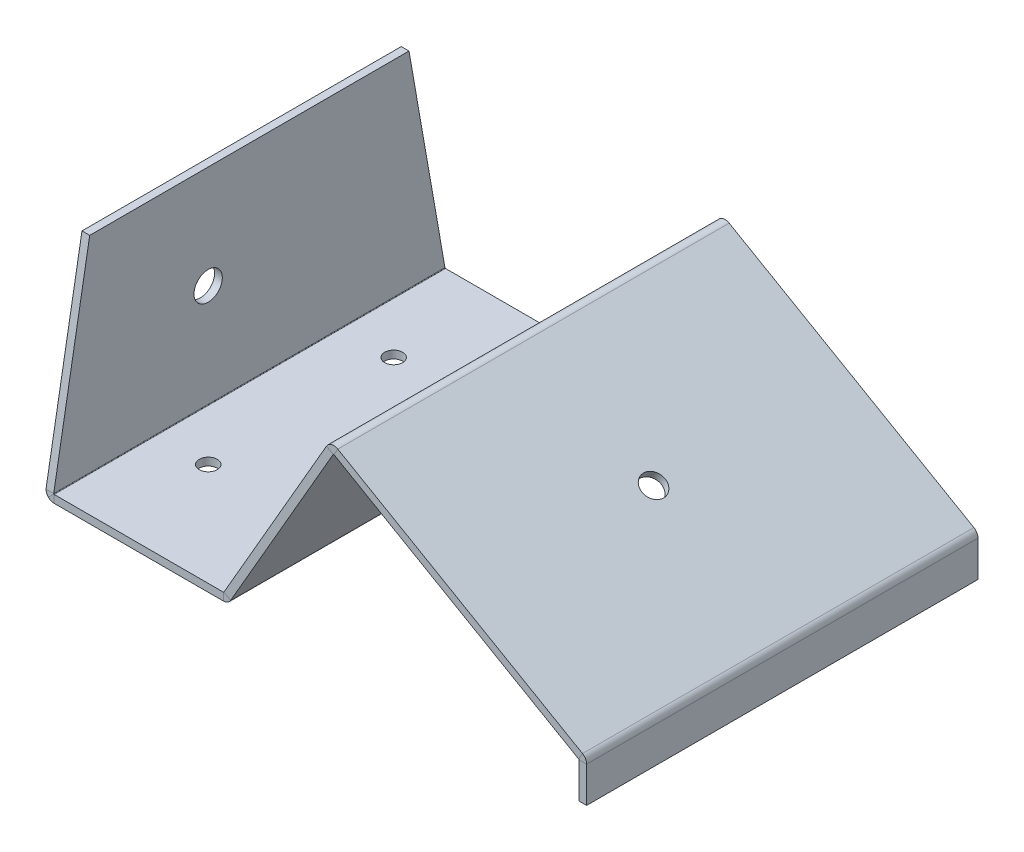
ISO-10303-21;
HEADER;
FILE_DESCRIPTION(('STEP AP214'),'2;1');
FILE_NAME('part.step','',(''),(''),'','','');
FILE_SCHEMA(('AUTOMOTIVE_DESIGN { 1 0 10303 214 1 1 1 1 }'));
ENDSEC;
DATA;
#1=APPLICATION_CONTEXT('core data for automotive mechanical design processes');
#2=APPLICATION_PROTOCOL_DEFINITION('international standard','automotive_design',2000,#1);
#3=PRODUCT_CONTEXT('',#1,'mechanical');
#4=PRODUCT('Part','Part','',(#3));
#5=PRODUCT_RELATED_PRODUCT_CATEGORY('part','',(#4));
#6=PRODUCT_DEFINITION_FORMATION('','',#4);
#7=PRODUCT_DEFINITION_CONTEXT('part definition',#1,'design');
#8=PRODUCT_DEFINITION('design','',#6,#7);
#9=PRODUCT_DEFINITION_SHAPE('','',#8);
#10=(LENGTH_UNIT() NAMED_UNIT(*) SI_UNIT(.MILLI.,.METRE.));
#11=(NAMED_UNIT(*) PLANE_ANGLE_UNIT() SI_UNIT($,.RADIAN.));
#12=(NAMED_UNIT(*) SI_UNIT($,.STERADIAN.) SOLID_ANGLE_UNIT());
#13=UNCERTAINTY_MEASURE_WITH_UNIT(LENGTH_MEASURE(1.E-05),#10,'distance_accuracy_value','');
#14=(GEOMETRIC_REPRESENTATION_CONTEXT(3) GLOBAL_UNCERTAINTY_ASSIGNED_CONTEXT((#13)) GLOBAL_UNIT_ASSIGNED_CONTEXT((#10,
#11,#12)) REPRESENTATION_CONTEXT('',''));
#15=CARTESIAN_POINT('',(0.,0.,0.));
#16=DIRECTION('',(0.,0.,1.));
#17=DIRECTION('',(1.,0.,0.));
#18=AXIS2_PLACEMENT_3D('',#15,#16,#17);
#19=CARTESIAN_POINT('',(148.77996314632,5.70255313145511,38.));
#20=DIRECTION('',(0.500000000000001,0.866025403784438,0.));
#21=DIRECTION('',(0.,0.,1.));
#22=AXIS2_PLACEMENT_3D('',#19,#20,#21);
#23=PLANE('',#22);
#24=CARTESIAN_POINT('',(118.469074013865,23.2025531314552,0.));
#25=DIRECTION('',(0.500000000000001,0.866025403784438,0.));
#26=DIRECTION('',(0.,0.,1.));
#27=AXIS2_PLACEMENT_3D('',#24,#25,#26);
#28=CIRCLE('',#27,2.25000000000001);
#29=CARTESIAN_POINT('',(118.469074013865,23.2025531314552,2.25000000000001));
#30=VERTEX_POINT('',#29);
#31=EDGE_CURVE('E292',#30,#30,#28,.T.);
#32=ORIENTED_EDGE('',*,*,#31,.F.);
#33=EDGE_LOOP('',(#32));
#34=FACE_BOUND('',#33,.T.);
#35=DIRECTION('',(0.866025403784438,-0.500000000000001,0.));
#36=VECTOR('',#35,1.);
#37=CARTESIAN_POINT('',(31.866533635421,73.2025531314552,38.));
#38=LINE('',#37,#36);
#39=CARTESIAN_POINT('',(95.1544157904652,36.663277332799,38.));
#40=VERTEX_POINT('',#39);
#41=CARTESIAN_POINT('',(142.672433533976,9.22873699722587,38.));
#42=VERTEX_POINT('',#41);
#43=EDGE_CURVE('E77',#40,#42,#38,.T.);
#44=ORIENTED_EDGE('',*,*,#43,.T.);
#45=DIRECTION('',(0.,0.,-1.));
#46=VECTOR('',#45,1.);
#47=CARTESIAN_POINT('',(142.672433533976,9.22873699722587,38.));
#48=LINE('',#47,#46);
#49=CARTESIAN_POINT('',(142.672433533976,9.22873699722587,-38.));
#50=VERTEX_POINT('',#49);
#51=EDGE_CURVE('E592',#42,#50,#48,.T.);
#52=ORIENTED_EDGE('',*,*,#51,.T.);
#53=DIRECTION('',(-0.866025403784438,0.500000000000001,0.));
#54=VECTOR('',#53,1.);
#55=CARTESIAN_POINT('',(31.866533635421,73.2025531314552,-38.));
#56=LINE('',#55,#54);
#57=CARTESIAN_POINT('',(95.154415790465,36.6632773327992,-38.));
#58=VERTEX_POINT('',#57);
#59=EDGE_CURVE('E291',#50,#58,#56,.T.);
#60=ORIENTED_EDGE('',*,*,#59,.T.);
#61=DIRECTION('',(0.,0.,-1.));
#62=VECTOR('',#61,1.);
#63=CARTESIAN_POINT('',(95.1544157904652,36.6632773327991,38.));
#64=LINE('',#63,#62);
#65=EDGE_CURVE('E276',#40,#58,#64,.T.);
#66=ORIENTED_EDGE('',*,*,#65,.F.);
#67=EDGE_LOOP('',(#44,#52,#60,#66));
#68=FACE_BOUND('',#67,.T.);
#69=ADVANCED_FACE('F73',(#34,#68),#23,.T.);
#70=CARTESIAN_POINT('',(124.008050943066,89.8392394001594,38.));
#71=DIRECTION('',(-0.86602540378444,0.499999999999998,0.));
#72=DIRECTION('',(0.,0.,1.));
#73=AXIS2_PLACEMENT_3D('',#70,#71,#72);
#74=PLANE('',#73);
#75=CARTESIAN_POINT('',(83.0080509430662,18.8251562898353,18.));
#76=DIRECTION('',(-0.86602540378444,0.499999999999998,0.));
#77=DIRECTION('',(0.,0.,-1.));
#78=AXIS2_PLACEMENT_3D('',#75,#76,#77);
#79=CIRCLE('',#78,1.75);
#80=CARTESIAN_POINT('',(83.0080509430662,18.8251562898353,16.25));
#81=VERTEX_POINT('',#80);
#82=EDGE_CURVE('E321',#81,#81,#79,.T.);
#83=ORIENTED_EDGE('',*,*,#82,.F.);
#84=EDGE_LOOP('',(#83));
#85=FACE_BOUND('',#84,.T.);
#86=CARTESIAN_POINT('',(83.0080509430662,18.8251562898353,-18.));
#87=DIRECTION('',(-0.86602540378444,0.499999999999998,0.));
#88=DIRECTION('',(0.,0.,1.));
#89=AXIS2_PLACEMENT_3D('',#86,#87,#88);
#90=CIRCLE('',#89,1.75);
#91=CARTESIAN_POINT('',(83.0080509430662,18.8251562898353,-16.25));
#92=VERTEX_POINT('',#91);
#93=EDGE_CURVE('E324',#92,#92,#90,.T.);
#94=ORIENTED_EDGE('',*,*,#93,.F.);
#95=EDGE_LOOP('',(#94));
#96=FACE_BOUND('',#95,.T.);
#97=DIRECTION('',(0.499999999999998,0.86602540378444,0.));
#98=VECTOR('',#97,1.);
#99=CARTESIAN_POINT('',(56.5080509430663,-27.07419011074,38.));
#100=LINE('',#99,#98);
#101=CARTESIAN_POINT('',(73.034234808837,1.55,38.));
#102=VERTEX_POINT('',#101);
#103=CARTESIAN_POINT('',(92.9687751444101,36.077636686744,38.));
#104=VERTEX_POINT('',#103);
#105=EDGE_CURVE('E319',#102,#104,#100,.T.);
#106=ORIENTED_EDGE('',*,*,#105,.T.);
#107=DIRECTION('',(0.,0.,-1.));
#108=VECTOR('',#107,1.);
#109=CARTESIAN_POINT('',(92.9687751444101,36.0776366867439,38.));
#110=LINE('',#109,#108);
#111=CARTESIAN_POINT('',(92.9687751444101,36.077636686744,-38.));
#112=VERTEX_POINT('',#111);
#113=EDGE_CURVE('E566',#104,#112,#110,.T.);
#114=ORIENTED_EDGE('',*,*,#113,.T.);
#115=DIRECTION('',(-0.499999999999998,-0.86602540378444,0.));
#116=VECTOR('',#115,1.);
#117=CARTESIAN_POINT('',(56.5080509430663,-27.07419011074,-38.));
#118=LINE('',#117,#116);
#119=CARTESIAN_POINT('',(73.034234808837,1.55,-38.));
#120=VERTEX_POINT('',#119);
#121=EDGE_CURVE('E320',#112,#120,#118,.T.);
#122=ORIENTED_EDGE('',*,*,#121,.T.);
#123=DIRECTION('',(0.,0.,1.));
#124=VECTOR('',#123,1.);
#125=CARTESIAN_POINT('',(73.034234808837,1.55,38.));
#126=LINE('',#125,#124);
#127=EDGE_CURVE('E317',#120,#102,#126,.T.);
#128=ORIENTED_EDGE('',*,*,#127,.T.);
#129=EDGE_LOOP('',(#106,#114,#122,#128));
#130=FACE_BOUND('',#129,.T.);
#131=ADVANCED_FACE('F651',(#85,#96,#130),#74,.T.);
#132=CARTESIAN_POINT('',(40.,1.5,-38.));
#133=DIRECTION('',(0.,0.,1.));
#134=DIRECTION('',(1.,0.,0.));
#135=AXIS2_PLACEMENT_3D('',#132,#133,#134);
#136=PLANE('',#135);
#137=DIRECTION('',(-1.,0.,0.));
#138=VECTOR('',#137,1.);
#139=CARTESIAN_POINT('',(40.,1.5,-38.));
#140=LINE('',#139,#138);
#141=CARTESIAN_POINT('',(72.9476322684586,1.5,-38.));
#142=VERTEX_POINT('',#141);
#143=CARTESIAN_POINT('',(40.0785515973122,1.5,-38.));
#144=VERTEX_POINT('',#143);
#145=EDGE_CURVE('E578',#142,#144,#140,.T.);
#146=ORIENTED_EDGE('',*,*,#145,.F.);
#147=DIRECTION('',(0.,-1.,0.));
#148=VECTOR('',#147,1.);
#149=CARTESIAN_POINT('',(72.9476322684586,1.5,-38.));
#150=LINE('',#149,#148);
#151=CARTESIAN_POINT('',(72.9476322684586,0.,-38.));
#152=VERTEX_POINT('',#151);
#153=EDGE_CURVE('E563',#142,#152,#150,.T.);
#154=ORIENTED_EDGE('',*,*,#153,.T.);
#155=DIRECTION('',(-1.,0.,0.));
#156=VECTOR('',#155,1.);
#157=CARTESIAN_POINT('',(40.,0.,-38.));
#158=LINE('',#157,#156);
#159=CARTESIAN_POINT('',(40.0785515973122,0.,-38.));
#160=VERTEX_POINT('',#159);
#161=EDGE_CURVE('E567',#152,#160,#158,.T.);
#162=ORIENTED_EDGE('',*,*,#161,.T.);
#163=DIRECTION('',(0.,-1.,0.));
#164=VECTOR('',#163,1.);
#165=CARTESIAN_POINT('',(40.0785515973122,1.5,-38.));
#166=LINE('',#165,#164);
#167=EDGE_CURVE('E1210',#144,#160,#166,.T.);
#168=ORIENTED_EDGE('',*,*,#167,.F.);
#169=EDGE_LOOP('',(#146,#154,#162,#168));
#170=FACE_BOUND('',#169,.T.);
#171=ADVANCED_FACE('F681',(#170),#136,.F.);
#172=CARTESIAN_POINT('',(175.,0.,38.));
#173=DIRECTION('',(0.,1.,0.));
#174=DIRECTION('',(0.,0.,1.));
#175=AXIS2_PLACEMENT_3D('',#172,#173,#174);
#176=PLANE('',#175);
#177=CARTESIAN_POINT('',(50.,0.,18.));
#178=DIRECTION('',(0.,1.,0.));
#179=DIRECTION('',(0.,0.,-1.));
#180=AXIS2_PLACEMENT_3D('',#177,#178,#179);
#181=CIRCLE('',#180,1.75);
#182=CARTESIAN_POINT('',(50.,0.,16.25));
#183=VERTEX_POINT('',#182);
#184=EDGE_CURVE('E503',#183,#183,#181,.T.);
#185=ORIENTED_EDGE('',*,*,#184,.T.);
#186=EDGE_LOOP('',(#185));
#187=FACE_BOUND('',#186,.T.);
#188=CARTESIAN_POINT('',(50.0000000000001,0.,-17.9999999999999));
#189=DIRECTION('',(0.,1.,0.));
#190=DIRECTION('',(0.,0.,1.));
#191=AXIS2_PLACEMENT_3D('',#188,#189,#190);
#192=CIRCLE('',#191,1.74999999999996);
#193=CARTESIAN_POINT('',(50.0000000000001,0.,-16.25));
#194=VERTEX_POINT('',#193);
#195=EDGE_CURVE('E573',#194,#194,#192,.T.);
#196=ORIENTED_EDGE('',*,*,#195,.T.);
#197=EDGE_LOOP('',(#196));
#198=FACE_BOUND('',#197,.T.);
#199=ORIENTED_EDGE('',*,*,#161,.F.);
#200=DIRECTION('',(0.,0.,1.));
#201=VECTOR('',#200,1.);
#202=CARTESIAN_POINT('',(72.9476322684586,0.,38.));
#203=LINE('',#202,#201);
#204=CARTESIAN_POINT('',(72.9476322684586,0.,38.));
#205=VERTEX_POINT('',#204);
#206=EDGE_CURVE('E560',#152,#205,#203,.T.);
#207=ORIENTED_EDGE('',*,*,#206,.T.);
#208=DIRECTION('',(1.,0.,0.));
#209=VECTOR('',#208,1.);
#210=CARTESIAN_POINT('',(40.,0.,38.));
#211=LINE('',#210,#209);
#212=CARTESIAN_POINT('',(40.0785515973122,0.,38.));
#213=VERTEX_POINT('',#212);
#214=EDGE_CURVE('E570',#213,#205,#211,.T.);
#215=ORIENTED_EDGE('',*,*,#214,.F.);
#216=DIRECTION('',(0.,0.,1.));
#217=VECTOR('',#216,1.);
#218=CARTESIAN_POINT('',(40.0785515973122,0.,38.));
#219=LINE('',#218,#217);
#220=EDGE_CURVE('E676',#160,#213,#219,.T.);
#221=ORIENTED_EDGE('',*,*,#220,.F.);
#222=EDGE_LOOP('',(#199,#207,#215,#221));
#223=FACE_BOUND('',#222,.T.);
#224=ADVANCED_FACE('F674',(#187,#198,#223),#176,.F.);
#225=CARTESIAN_POINT('',(40.,1.5,38.));
#226=DIRECTION('',(0.,0.,-1.));
#227=DIRECTION('',(-1.,0.,0.));
#228=AXIS2_PLACEMENT_3D('',#225,#226,#227);
#229=PLANE('',#228);
#230=ORIENTED_EDGE('',*,*,#214,.T.);
#231=DIRECTION('',(0.,1.,0.));
#232=VECTOR('',#231,1.);
#233=CARTESIAN_POINT('',(72.9476322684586,1.5,38.));
#234=LINE('',#233,#232);
#235=CARTESIAN_POINT('',(72.9476322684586,1.5,38.));
#236=VERTEX_POINT('',#235);
#237=EDGE_CURVE('E556',#205,#236,#234,.T.);
#238=ORIENTED_EDGE('',*,*,#237,.T.);
#239=DIRECTION('',(1.,0.,0.));
#240=VECTOR('',#239,1.);
#241=CARTESIAN_POINT('',(40.,1.5,38.));
#242=LINE('',#241,#240);
#243=CARTESIAN_POINT('',(40.0785515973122,1.5,38.));
#244=VERTEX_POINT('',#243);
#245=EDGE_CURVE('E574',#244,#236,#242,.T.);
#246=ORIENTED_EDGE('',*,*,#245,.F.);
#247=DIRECTION('',(0.,1.,0.));
#248=VECTOR('',#247,1.);
#249=CARTESIAN_POINT('',(40.0785515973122,1.5,38.));
#250=LINE('',#249,#248);
#251=EDGE_CURVE('E1212',#213,#244,#250,.T.);
#252=ORIENTED_EDGE('',*,*,#251,.F.);
#253=EDGE_LOOP('',(#230,#238,#246,#252));
#254=FACE_BOUND('',#253,.T.);
#255=ADVANCED_FACE('F540',(#254),#229,.F.);
#256=CARTESIAN_POINT('',(39.9785515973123,41.5214484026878,31.));
#257=DIRECTION('',(0.,-0.172380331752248,-0.985030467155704));
#258=DIRECTION('',(0.,0.985030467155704,-0.172380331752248));
#259=AXIS2_PLACEMENT_3D('',#256,#257,#258);
#260=PLANE('',#259);
#261=DIRECTION('',(0.,-0.985030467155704,0.172380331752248));
#262=VECTOR('',#261,1.);
#263=CARTESIAN_POINT('',(38.4785515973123,41.5214484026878,31.));
#264=LINE('',#263,#262);
#265=CARTESIAN_POINT('',(38.4785515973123,41.5214484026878,31.));
#266=VERTEX_POINT('',#265);
#267=CARTESIAN_POINT('',(38.4785515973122,1.6,37.9862534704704));
#268=VERTEX_POINT('',#267);
#269=EDGE_CURVE('E1149',#266,#268,#264,.T.);
#270=ORIENTED_EDGE('',*,*,#269,.T.);
#271=CARTESIAN_POINT('',(39.9785515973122,1.6,37.9862534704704));
#272=CARTESIAN_POINT('',(38.4785515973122,1.6,37.9862534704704));
#273=B_SPLINE_CURVE_WITH_KNOTS('',1,(#271,#272),.UNSPECIFIED.,.F.,.F.,(2,2),(0.,1.),.UNSPECIFIED.);
#274=CARTESIAN_POINT('',(39.9785515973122,1.6,37.9862534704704));
#275=VERTEX_POINT('',#274);
#276=EDGE_CURVE('E1140',#268,#275,#273,.F.);
#277=ORIENTED_EDGE('',*,*,#276,.T.);
#278=DIRECTION('',(0.,-0.985030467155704,0.172380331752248));
#279=VECTOR('',#278,1.);
#280=CARTESIAN_POINT('',(39.9785515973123,41.5214484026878,31.));
#281=LINE('',#280,#279);
#282=CARTESIAN_POINT('',(39.9785515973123,41.5214484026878,31.));
#283=VERTEX_POINT('',#282);
#284=EDGE_CURVE('E1166',#283,#275,#281,.T.);
#285=ORIENTED_EDGE('',*,*,#284,.F.);
#286=DIRECTION('',(-1.,0.,0.));
#287=VECTOR('',#286,1.);
#288=CARTESIAN_POINT('',(39.9785515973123,41.5214484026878,31.));
#289=LINE('',#288,#287);
#290=EDGE_CURVE('E1163',#283,#266,#289,.T.);
#291=ORIENTED_EDGE('',*,*,#290,.T.);
#292=EDGE_LOOP('',(#270,#277,#285,#291));
#293=FACE_BOUND('',#292,.T.);
#294=ADVANCED_FACE('F535',(#293),#260,.F.);
#295=CARTESIAN_POINT('',(39.9785515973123,41.5214484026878,-31.));
#296=DIRECTION('',(0.,-0.172380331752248,0.985030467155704));
#297=DIRECTION('',(0.,-0.985030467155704,-0.172380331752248));
#298=AXIS2_PLACEMENT_3D('',#295,#296,#297);
#299=PLANE('',#298);
#300=DIRECTION('',(0.,0.985030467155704,0.172380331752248));
#301=VECTOR('',#300,1.);
#302=CARTESIAN_POINT('',(39.9785515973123,41.5214484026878,-31.));
#303=LINE('',#302,#301);
#304=CARTESIAN_POINT('',(39.9785515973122,1.6,-37.9862534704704));
#305=VERTEX_POINT('',#304);
#306=CARTESIAN_POINT('',(39.9785515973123,41.5214484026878,-31.));
#307=VERTEX_POINT('',#306);
#308=EDGE_CURVE('E1150',#305,#307,#303,.T.);
#309=ORIENTED_EDGE('',*,*,#308,.F.);
#310=CARTESIAN_POINT('',(38.4785515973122,1.6,-37.9862534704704));
#311=CARTESIAN_POINT('',(39.9785515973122,1.6,-37.9862534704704));
#312=B_SPLINE_CURVE_WITH_KNOTS('',1,(#310,#311),.UNSPECIFIED.,.F.,.F.,(2,2),(0.,1.),.UNSPECIFIED.);
#313=CARTESIAN_POINT('',(38.4785515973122,1.6,-37.9862534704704));
#314=VERTEX_POINT('',#313);
#315=EDGE_CURVE('E557',#305,#314,#312,.F.);
#316=ORIENTED_EDGE('',*,*,#315,.T.);
#317=DIRECTION('',(0.,0.985030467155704,0.172380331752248));
#318=VECTOR('',#317,1.);
#319=CARTESIAN_POINT('',(38.4785515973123,41.5214484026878,-31.));
#320=LINE('',#319,#318);
#321=CARTESIAN_POINT('',(38.4785515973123,41.5214484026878,-31.));
#322=VERTEX_POINT('',#321);
#323=EDGE_CURVE('E1143',#314,#322,#320,.T.);
#324=ORIENTED_EDGE('',*,*,#323,.T.);
#325=DIRECTION('',(-1.,0.,0.));
#326=VECTOR('',#325,1.);
#327=CARTESIAN_POINT('',(39.9785515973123,41.5214484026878,-31.));
#328=LINE('',#327,#326);
#329=EDGE_CURVE('E1165',#307,#322,#328,.T.);
#330=ORIENTED_EDGE('',*,*,#329,.F.);
#331=EDGE_LOOP('',(#309,#316,#324,#330));
#332=FACE_BOUND('',#331,.T.);
#333=ADVANCED_FACE('F539',(#332),#299,.F.);
#334=CARTESIAN_POINT('',(38.4785515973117,-133.478551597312,38.));
#335=DIRECTION('',(1.,0.,0.));
#336=DIRECTION('',(0.,0.,1.));
#337=AXIS2_PLACEMENT_3D('',#334,#335,#336);
#338=PLANE('',#337);
#339=CARTESIAN_POINT('',(38.4785515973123,21.5214484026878,8.));
#340=DIRECTION('',(1.,0.,0.));
#341=DIRECTION('',(0.,0.,1.));
#342=AXIS2_PLACEMENT_3D('',#339,#340,#341);
#343=CIRCLE('',#342,2.75);
#344=CARTESIAN_POINT('',(38.4785515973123,21.5214484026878,10.75));
#345=VERTEX_POINT('',#344);
#346=EDGE_CURVE('E569',#345,#345,#343,.T.);
#347=ORIENTED_EDGE('',*,*,#346,.T.);
#348=EDGE_LOOP('',(#347));
#349=FACE_BOUND('',#348,.T.);
#350=ORIENTED_EDGE('',*,*,#323,.F.);
#351=DIRECTION('',(0.,0.,1.));
#352=VECTOR('',#351,1.);
#353=CARTESIAN_POINT('',(38.4785515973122,1.60000000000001,38.));
#354=LINE('',#353,#352);
#355=EDGE_CURVE('E1132',#314,#268,#354,.T.);
#356=ORIENTED_EDGE('',*,*,#355,.T.);
#357=ORIENTED_EDGE('',*,*,#269,.F.);
#358=DIRECTION('',(0.,0.,1.));
#359=VECTOR('',#358,1.);
#360=CARTESIAN_POINT('',(38.4785515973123,41.5214484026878,31.));
#361=LINE('',#360,#359);
#362=EDGE_CURVE('E1145',#322,#266,#361,.T.);
#363=ORIENTED_EDGE('',*,*,#362,.F.);
#364=EDGE_LOOP('',(#350,#356,#357,#363));
#365=FACE_BOUND('',#364,.T.);
#366=ADVANCED_FACE('F533',(#349,#365),#338,.F.);
#367=CARTESIAN_POINT('',(39.9785515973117,-133.478551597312,38.));
#368=DIRECTION('',(1.,0.,0.));
#369=DIRECTION('',(0.,0.,1.));
#370=AXIS2_PLACEMENT_3D('',#367,#368,#369);
#371=PLANE('',#370);
#372=DIRECTION('',(0.,0.,1.));
#373=VECTOR('',#372,1.);
#374=CARTESIAN_POINT('',(39.9785515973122,1.6,38.));
#375=LINE('',#374,#373);
#376=EDGE_CURVE('E1168',#305,#275,#375,.T.);
#377=ORIENTED_EDGE('',*,*,#376,.F.);
#378=ORIENTED_EDGE('',*,*,#308,.T.);
#379=DIRECTION('',(0.,0.,1.));
#380=VECTOR('',#379,1.);
#381=CARTESIAN_POINT('',(39.9785515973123,41.5214484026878,31.));
#382=LINE('',#381,#380);
#383=EDGE_CURVE('E1154',#307,#283,#382,.T.);
#384=ORIENTED_EDGE('',*,*,#383,.T.);
#385=ORIENTED_EDGE('',*,*,#284,.T.);
#386=EDGE_LOOP('',(#377,#378,#384,#385));
#387=FACE_BOUND('',#386,.T.);
#388=CARTESIAN_POINT('',(39.9785515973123,21.5214484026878,8.));
#389=DIRECTION('',(1.,0.,0.));
#390=DIRECTION('',(0.,0.,1.));
#391=AXIS2_PLACEMENT_3D('',#388,#389,#390);
#392=CIRCLE('',#391,2.75);
#393=CARTESIAN_POINT('',(39.9785515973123,21.5214484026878,10.75));
#394=VERTEX_POINT('',#393);
#395=EDGE_CURVE('E1146',#394,#394,#392,.T.);
#396=ORIENTED_EDGE('',*,*,#395,.F.);
#397=EDGE_LOOP('',(#396));
#398=FACE_BOUND('',#397,.T.);
#399=ADVANCED_FACE('F529',(#387,#398),#371,.T.);
#400=CARTESIAN_POINT('',(39.9785515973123,41.5214484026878,31.));
#401=DIRECTION('',(0.,-1.,0.));
#402=DIRECTION('',(0.,0.,-1.));
#403=AXIS2_PLACEMENT_3D('',#400,#401,#402);
#404=PLANE('',#403);
#405=ORIENTED_EDGE('',*,*,#362,.T.);
#406=ORIENTED_EDGE('',*,*,#290,.F.);
#407=ORIENTED_EDGE('',*,*,#383,.F.);
#408=ORIENTED_EDGE('',*,*,#329,.T.);
#409=EDGE_LOOP('',(#405,#406,#407,#408));
#410=FACE_BOUND('',#409,.T.);
#411=ADVANCED_FACE('F525',(#410),#404,.F.);
#412=CARTESIAN_POINT('',(39.9785515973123,21.5214484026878,8.));
#413=DIRECTION('',(-1.,0.,0.));
#414=DIRECTION('',(0.,0.,-1.));
#415=AXIS2_PLACEMENT_3D('',#412,#413,#414);
#416=CYLINDRICAL_SURFACE('',#415,2.75);
#417=ORIENTED_EDGE('',*,*,#395,.T.);
#418=EDGE_LOOP('',(#417));
#419=FACE_BOUND('',#418,.T.);
#420=ORIENTED_EDGE('',*,*,#346,.F.);
#421=EDGE_LOOP('',(#420));
#422=FACE_BOUND('',#421,.T.);
#423=ADVANCED_FACE('F517',(#419,#422),#416,.F.);
#424=CARTESIAN_POINT('',(50.,1.5,18.));
#425=DIRECTION('',(0.,-1.,0.));
#426=DIRECTION('',(0.,0.,-1.));
#427=AXIS2_PLACEMENT_3D('',#424,#425,#426);
#428=CYLINDRICAL_SURFACE('',#427,1.75);
#429=CARTESIAN_POINT('',(50.,1.5,18.));
#430=DIRECTION('',(0.,1.,0.));
#431=DIRECTION('',(0.,0.,-1.));
#432=AXIS2_PLACEMENT_3D('',#429,#430,#431);
#433=CIRCLE('',#432,1.75);
#434=CARTESIAN_POINT('',(50.,1.5,16.25));
#435=VERTEX_POINT('',#434);
#436=EDGE_CURVE('E1222',#435,#435,#433,.T.);
#437=ORIENTED_EDGE('',*,*,#436,.T.);
#438=EDGE_LOOP('',(#437));
#439=FACE_BOUND('',#438,.T.);
#440=ORIENTED_EDGE('',*,*,#184,.F.);
#441=EDGE_LOOP('',(#440));
#442=FACE_BOUND('',#441,.T.);
#443=ADVANCED_FACE('F513',(#439,#442),#428,.F.);
#444=CARTESIAN_POINT('',(50.0000000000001,1.5,-17.9999999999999));
#445=DIRECTION('',(0.,-1.,0.));
#446=DIRECTION('',(0.,0.,-1.));
#447=AXIS2_PLACEMENT_3D('',#444,#445,#446);
#448=CYLINDRICAL_SURFACE('',#447,1.74999999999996);
#449=CARTESIAN_POINT('',(50.0000000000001,1.5,-17.9999999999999));
#450=DIRECTION('',(0.,1.,0.));
#451=DIRECTION('',(0.,0.,1.));
#452=AXIS2_PLACEMENT_3D('',#449,#450,#451);
#453=CIRCLE('',#452,1.74999999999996);
#454=CARTESIAN_POINT('',(50.0000000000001,1.5,-16.25));
#455=VERTEX_POINT('',#454);
#456=EDGE_CURVE('E580',#455,#455,#453,.T.);
#457=ORIENTED_EDGE('',*,*,#456,.T.);
#458=EDGE_LOOP('',(#457));
#459=FACE_BOUND('',#458,.T.);
#460=ORIENTED_EDGE('',*,*,#195,.F.);
#461=EDGE_LOOP('',(#460));
#462=FACE_BOUND('',#461,.T.);
#463=ADVANCED_FACE('F516',(#459,#462),#448,.F.);
#464=CARTESIAN_POINT('',(175.,1.5,38.));
#465=DIRECTION('',(0.,1.,0.));
#466=DIRECTION('',(0.,0.,1.));
#467=AXIS2_PLACEMENT_3D('',#464,#465,#466);
#468=PLANE('',#467);
#469=DIRECTION('',(0.,0.,1.));
#470=VECTOR('',#469,1.);
#471=CARTESIAN_POINT('',(72.9476322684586,1.5,38.));
#472=LINE('',#471,#470);
#473=EDGE_CURVE('E549',#142,#236,#472,.T.);
#474=ORIENTED_EDGE('',*,*,#473,.F.);
#475=ORIENTED_EDGE('',*,*,#145,.T.);
#476=DIRECTION('',(0.,0.,1.));
#477=VECTOR('',#476,1.);
#478=CARTESIAN_POINT('',(40.0785515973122,1.5,38.));
#479=LINE('',#478,#477);
#480=EDGE_CURVE('E577',#144,#244,#479,.T.);
#481=ORIENTED_EDGE('',*,*,#480,.T.);
#482=ORIENTED_EDGE('',*,*,#245,.T.);
#483=EDGE_LOOP('',(#474,#475,#481,#482));
#484=FACE_BOUND('',#483,.T.);
#485=ORIENTED_EDGE('',*,*,#456,.F.);
#486=EDGE_LOOP('',(#485));
#487=FACE_BOUND('',#486,.T.);
#488=ORIENTED_EDGE('',*,*,#436,.F.);
#489=EDGE_LOOP('',(#488));
#490=FACE_BOUND('',#489,.T.);
#491=ADVANCED_FACE('F521',(#484,#487,#490),#468,.T.);
#492=CARTESIAN_POINT('',(40.0785515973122,1.6,-38.));
#493=DIRECTION('',(0.,0.,1.));
#494=DIRECTION('',(1.,0.,0.));
#495=AXIS2_PLACEMENT_3D('',#492,#493,#494);
#496=PLANE('',#495);
#497=ORIENTED_EDGE('',*,*,#167,.T.);
#498=CARTESIAN_POINT('',(40.0785515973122,1.6,-38.));
#499=DIRECTION('',(0.,0.,1.));
#500=DIRECTION('',(1.,0.,0.));
#501=AXIS2_PLACEMENT_3D('',#498,#499,#500);
#502=CIRCLE('',#501,1.6);
#503=CARTESIAN_POINT('',(38.9471807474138,0.468629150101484,-38.));
#504=VERTEX_POINT('',#503);
#505=EDGE_CURVE('E342',#160,#504,#502,.F.);
#506=ORIENTED_EDGE('',*,*,#505,.T.);
#507=CARTESIAN_POINT('',(40.0078409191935,1.52928932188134,-38.));
#508=CARTESIAN_POINT('',(38.9471807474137,0.468629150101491,-38.));
#509=B_SPLINE_CURVE_WITH_KNOTS('',1,(#507,#508),.UNSPECIFIED.,.F.,.F.,(2,2),(0.,1.),.UNSPECIFIED.);
#510=CARTESIAN_POINT('',(40.0078409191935,1.52928932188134,-38.));
#511=VERTEX_POINT('',#510);
#512=EDGE_CURVE('E466',#504,#511,#509,.F.);
#513=ORIENTED_EDGE('',*,*,#512,.T.);
#514=CARTESIAN_POINT('',(40.0785515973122,1.6,-38.));
#515=DIRECTION('',(0.,0.,-1.));
#516=DIRECTION('',(-1.,0.,0.));
#517=AXIS2_PLACEMENT_3D('',#514,#515,#516);
#518=CIRCLE('',#517,0.100000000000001);
#519=EDGE_CURVE('E391',#144,#511,#518,.T.);
#520=ORIENTED_EDGE('',*,*,#519,.F.);
#521=EDGE_LOOP('',(#497,#506,#513,#520));
#522=FACE_BOUND('',#521,.T.);
#523=ADVANCED_FACE('F434',(#522),#496,.F.);
#524=CARTESIAN_POINT('',(38.9471807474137,0.468629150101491,-38.));
#525=CARTESIAN_POINT('',(38.7990579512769,0.616751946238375,-37.9977335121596));
#526=CARTESIAN_POINT('',(38.6804933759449,0.794209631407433,-37.9954553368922));
#527=CARTESIAN_POINT('',(38.5201953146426,1.18120338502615,-37.9908731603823));
#528=CARTESIAN_POINT('',(38.4785515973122,1.39052273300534,-37.9885699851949));
#529=CARTESIAN_POINT('',(38.4785515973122,1.6,-37.9862534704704));
#530=CARTESIAN_POINT('',(40.0078409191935,1.52928932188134,-38.));
#531=CARTESIAN_POINT('',(39.9985832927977,1.53854694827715,-37.9977335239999));
#532=CARTESIAN_POINT('',(39.9911729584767,1.54963810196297,-37.9954553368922));
#533=CARTESIAN_POINT('',(39.9811543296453,1.57382521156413,-37.9908731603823));
#534=CARTESIAN_POINT('',(39.9785515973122,1.58690774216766,-37.9885699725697));
#535=CARTESIAN_POINT('',(39.9785515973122,1.6,-37.9862534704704));
#536=B_SPLINE_SURFACE_WITH_KNOTS('',1,3,((#524,#525,#526,#527,#528,#529),(#530,#531,#532,#533,
#534,#535)),.UNSPECIFIED.,.F.,.F.,.F.,(2,2),(4,2,4),(0.,1.),(0.,0.5,1.),.UNSPECIFIED.);
#537=CARTESIAN_POINT('',(38.9471807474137,0.468629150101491,-38.));
#538=CARTESIAN_POINT('',(38.7990579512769,0.616751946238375,-37.9977335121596));
#539=CARTESIAN_POINT('',(38.6804933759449,0.794209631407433,-37.9954553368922));
#540=CARTESIAN_POINT('',(38.5201953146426,1.18120338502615,-37.9908731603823));
#541=CARTESIAN_POINT('',(38.4785515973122,1.39052273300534,-37.9885699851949));
#542=CARTESIAN_POINT('',(38.4785515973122,1.6,-37.9862534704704));
#543=B_SPLINE_CURVE_WITH_KNOTS('',3,(#537,#538,#539,#540,#541,#542),.UNSPECIFIED.,.F.,.F.,(4,2,
4),(0.,0.5,1.),.UNSPECIFIED.);
#544=EDGE_CURVE('E402',#504,#314,#543,.T.);
#545=CARTESIAN_POINT('',(39.9785515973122,1.6,-37.9862534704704));
#546=CARTESIAN_POINT('',(39.9785515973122,1.58690774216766,-37.9885699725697));
#547=CARTESIAN_POINT('',(39.9811543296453,1.57382521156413,-37.9908731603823));
#548=CARTESIAN_POINT('',(39.9911729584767,1.54963810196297,-37.9954553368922));
#549=CARTESIAN_POINT('',(39.9985832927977,1.53854694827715,-37.9977335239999));
#550=CARTESIAN_POINT('',(40.0078409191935,1.52928932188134,-38.));
#551=B_SPLINE_CURVE_WITH_KNOTS('',3,(#545,#546,#547,#548,#549,#550),.UNSPECIFIED.,.F.,.F.,(4,2,
4),(0.,0.5,1.),.UNSPECIFIED.);
#552=EDGE_CURVE('E390',#511,#305,#551,.F.);
#553=ORIENTED_EDGE('',*,*,#512,.F.);
#554=ORIENTED_EDGE('',*,*,#544,.T.);
#555=ORIENTED_EDGE('',*,*,#315,.F.);
#556=ORIENTED_EDGE('',*,*,#552,.F.);
#557=EDGE_LOOP('',(#553,#554,#555,#556));
#558=FACE_BOUND('',#557,.T.);
#559=ADVANCED_FACE('F423',(#558),#536,.F.);
#560=CARTESIAN_POINT('',(38.4785515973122,1.6,37.9862534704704));
#561=CARTESIAN_POINT('',(38.4785515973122,1.39052273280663,37.9885199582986));
#562=CARTESIAN_POINT('',(38.5201953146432,1.1812033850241,37.99079813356));
#563=CARTESIAN_POINT('',(38.6804933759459,0.794209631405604,37.9953803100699));
#564=CARTESIAN_POINT('',(38.7990579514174,0.616751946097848,37.9976834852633));
#565=CARTESIAN_POINT('',(38.9471807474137,0.468629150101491,38.));
#566=CARTESIAN_POINT('',(39.9785515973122,1.6,37.9862534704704));
#567=CARTESIAN_POINT('',(39.9785515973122,1.58690773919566,37.9885199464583));
#568=CARTESIAN_POINT('',(39.9811543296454,1.57382521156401,37.99079813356));
#569=CARTESIAN_POINT('',(39.9911729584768,1.54963810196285,37.9953803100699));
#570=CARTESIAN_POINT('',(39.9985832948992,1.53854694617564,37.9976834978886));
#571=CARTESIAN_POINT('',(40.0078409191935,1.52928932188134,38.));
#572=B_SPLINE_SURFACE_WITH_KNOTS('',1,3,((#560,#561,#562,#563,#564,#565),(#566,#567,#568,#569,
#570,#571)),.UNSPECIFIED.,.F.,.F.,.F.,(2,2),(4,2,4),(0.,1.),(0.,0.5,1.),.UNSPECIFIED.);
#573=CARTESIAN_POINT('',(38.4785515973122,1.6,37.9862534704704));
#574=CARTESIAN_POINT('',(38.4785515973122,1.39052273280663,37.9885199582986));
#575=CARTESIAN_POINT('',(38.5201953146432,1.1812033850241,37.99079813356));
#576=CARTESIAN_POINT('',(38.6804933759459,0.794209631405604,37.9953803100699));
#577=CARTESIAN_POINT('',(38.7990579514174,0.616751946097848,37.9976834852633));
#578=CARTESIAN_POINT('',(38.9471807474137,0.468629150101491,38.));
#579=B_SPLINE_CURVE_WITH_KNOTS('',3,(#573,#574,#575,#576,#577,#578),.UNSPECIFIED.,.F.,.F.,(4,2,
4),(0.,0.5,1.),.UNSPECIFIED.);
#580=CARTESIAN_POINT('',(38.9471807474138,0.468629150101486,38.));
#581=VERTEX_POINT('',#580);
#582=EDGE_CURVE('E1184',#268,#581,#579,.T.);
#583=CARTESIAN_POINT('',(38.9471807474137,0.468629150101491,38.));
#584=CARTESIAN_POINT('',(40.0078409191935,1.52928932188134,38.));
#585=B_SPLINE_CURVE_WITH_KNOTS('',1,(#583,#584),.UNSPECIFIED.,.F.,.F.,(2,2),(0.,1.),.UNSPECIFIED.);
#586=CARTESIAN_POINT('',(40.0078409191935,1.52928932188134,38.));
#587=VERTEX_POINT('',#586);
#588=EDGE_CURVE('E487',#581,#587,#585,.T.);
#589=CARTESIAN_POINT('',(40.0078409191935,1.52928932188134,38.));
#590=CARTESIAN_POINT('',(39.9985832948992,1.53854694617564,37.9976834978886));
#591=CARTESIAN_POINT('',(39.9911729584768,1.54963810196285,37.9953803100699));
#592=CARTESIAN_POINT('',(39.9811543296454,1.57382521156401,37.99079813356));
#593=CARTESIAN_POINT('',(39.9785515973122,1.58690773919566,37.9885199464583));
#594=CARTESIAN_POINT('',(39.9785515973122,1.6,37.9862534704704));
#595=B_SPLINE_CURVE_WITH_KNOTS('',3,(#589,#590,#591,#592,#593,#594),.UNSPECIFIED.,.F.,.F.,(4,2,
4),(0.,0.5,1.),.UNSPECIFIED.);
#596=EDGE_CURVE('E1194',#275,#587,#595,.F.);
#597=ORIENTED_EDGE('',*,*,#276,.F.);
#598=ORIENTED_EDGE('',*,*,#582,.T.);
#599=ORIENTED_EDGE('',*,*,#588,.T.);
#600=ORIENTED_EDGE('',*,*,#596,.F.);
#601=EDGE_LOOP('',(#597,#598,#599,#600));
#602=FACE_BOUND('',#601,.T.);
#603=ADVANCED_FACE('F366',(#602),#572,.F.);
#604=CARTESIAN_POINT('',(40.0785515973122,1.6,38.));
#605=DIRECTION('',(0.,0.,-1.));
#606=DIRECTION('',(-1.,0.,0.));
#607=AXIS2_PLACEMENT_3D('',#604,#605,#606);
#608=PLANE('',#607);
#609=CARTESIAN_POINT('',(40.0785515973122,1.6,38.));
#610=DIRECTION('',(0.,0.,1.));
#611=DIRECTION('',(1.,0.,0.));
#612=AXIS2_PLACEMENT_3D('',#609,#610,#611);
#613=CIRCLE('',#612,1.6);
#614=EDGE_CURVE('E393',#581,#213,#613,.T.);
#615=ORIENTED_EDGE('',*,*,#614,.T.);
#616=ORIENTED_EDGE('',*,*,#251,.T.);
#617=CARTESIAN_POINT('',(40.0785515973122,1.6,38.));
#618=DIRECTION('',(0.,0.,1.));
#619=DIRECTION('',(1.,0.,0.));
#620=AXIS2_PLACEMENT_3D('',#617,#618,#619);
#621=CIRCLE('',#620,0.100000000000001);
#622=EDGE_CURVE('E1204',#587,#244,#621,.T.);
#623=ORIENTED_EDGE('',*,*,#622,.F.);
#624=ORIENTED_EDGE('',*,*,#588,.F.);
#625=EDGE_LOOP('',(#615,#616,#623,#624));
#626=FACE_BOUND('',#625,.T.);
#627=ADVANCED_FACE('F364',(#626),#608,.F.);
#628=CARTESIAN_POINT('',(40.0785515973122,1.6,-76.014963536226));
#629=DIRECTION('',(0.,0.,1.));
#630=DIRECTION('',(1.,0.,0.));
#631=AXIS2_PLACEMENT_3D('',#628,#629,#630);
#632=CYLINDRICAL_SURFACE('',#631,0.1);
#633=ORIENTED_EDGE('',*,*,#596,.T.);
#634=ORIENTED_EDGE('',*,*,#622,.T.);
#635=ORIENTED_EDGE('',*,*,#480,.F.);
#636=ORIENTED_EDGE('',*,*,#519,.T.);
#637=ORIENTED_EDGE('',*,*,#552,.T.);
#638=ORIENTED_EDGE('',*,*,#376,.T.);
#639=EDGE_LOOP('',(#633,#634,#635,#636,#637,#638));
#640=FACE_BOUND('',#639,.T.);
#641=ADVANCED_FACE('F353',(#640),#632,.F.);
#642=CARTESIAN_POINT('',(40.0785515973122,1.6,-76.014963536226));
#643=DIRECTION('',(0.,0.,1.));
#644=DIRECTION('',(1.,0.,0.));
#645=AXIS2_PLACEMENT_3D('',#642,#643,#644);
#646=CYLINDRICAL_SURFACE('',#645,1.6);
#647=ORIENTED_EDGE('',*,*,#582,.F.);
#648=ORIENTED_EDGE('',*,*,#355,.F.);
#649=ORIENTED_EDGE('',*,*,#544,.F.);
#650=ORIENTED_EDGE('',*,*,#505,.F.);
#651=ORIENTED_EDGE('',*,*,#220,.T.);
#652=ORIENTED_EDGE('',*,*,#614,.F.);
#653=EDGE_LOOP('',(#647,#648,#649,#650,#651,#652));
#654=FACE_BOUND('',#653,.T.);
#655=ADVANCED_FACE('F363',(#654),#646,.T.);
#656=CARTESIAN_POINT('',(72.9476322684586,1.6,-38.));
#657=DIRECTION('',(0.,0.,1.));
#658=DIRECTION('',(1.,0.,0.));
#659=AXIS2_PLACEMENT_3D('',#656,#657,#658);
#660=PLANE('',#659);
#661=DIRECTION('',(0.86602540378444,-0.499999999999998,0.));
#662=VECTOR('',#661,1.);
#663=CARTESIAN_POINT('',(73.034234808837,1.55,-38.));
#664=LINE('',#663,#662);
#665=CARTESIAN_POINT('',(74.3332729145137,0.800000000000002,-38.));
#666=VERTEX_POINT('',#665);
#667=EDGE_CURVE('E304',#120,#666,#664,.T.);
#668=ORIENTED_EDGE('',*,*,#667,.T.);
#669=CARTESIAN_POINT('',(72.9476322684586,1.6,-38.));
#670=DIRECTION('',(0.,0.,-1.));
#671=DIRECTION('',(-1.,0.,0.));
#672=AXIS2_PLACEMENT_3D('',#669,#670,#671);
#673=CIRCLE('',#672,1.6);
#674=EDGE_CURVE('E343',#666,#152,#673,.T.);
#675=ORIENTED_EDGE('',*,*,#674,.T.);
#676=ORIENTED_EDGE('',*,*,#153,.F.);
#677=CARTESIAN_POINT('',(72.9476322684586,1.6,-38.));
#678=DIRECTION('',(0.,0.,-1.));
#679=DIRECTION('',(-1.,0.,0.));
#680=AXIS2_PLACEMENT_3D('',#677,#678,#679);
#681=CIRCLE('',#680,0.0999999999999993);
#682=EDGE_CURVE('E335',#120,#142,#681,.T.);
#683=ORIENTED_EDGE('',*,*,#682,.F.);
#684=EDGE_LOOP('',(#668,#675,#676,#683));
#685=FACE_BOUND('',#684,.T.);
#686=ADVANCED_FACE('F667',(#685),#660,.F.);
#687=CARTESIAN_POINT('',(72.9476322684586,1.6,38.));
#688=DIRECTION('',(0.,0.,-1.));
#689=DIRECTION('',(-1.,0.,0.));
#690=AXIS2_PLACEMENT_3D('',#687,#688,#689);
#691=PLANE('',#690);
#692=CARTESIAN_POINT('',(72.9476322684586,1.6,38.));
#693=DIRECTION('',(0.,0.,-1.));
#694=DIRECTION('',(-1.,0.,0.));
#695=AXIS2_PLACEMENT_3D('',#692,#693,#694);
#696=CIRCLE('',#695,1.6);
#697=CARTESIAN_POINT('',(74.3332729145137,0.800000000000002,38.));
#698=VERTEX_POINT('',#697);
#699=EDGE_CURVE('E339',#205,#698,#696,.F.);
#700=ORIENTED_EDGE('',*,*,#699,.T.);
#701=DIRECTION('',(-0.86602540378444,0.499999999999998,0.));
#702=VECTOR('',#701,1.);
#703=CARTESIAN_POINT('',(73.034234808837,1.55,38.));
#704=LINE('',#703,#702);
#705=EDGE_CURVE('E327',#698,#102,#704,.T.);
#706=ORIENTED_EDGE('',*,*,#705,.T.);
#707=CARTESIAN_POINT('',(72.9476322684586,1.6,38.));
#708=DIRECTION('',(0.,0.,1.));
#709=DIRECTION('',(1.,0.,0.));
#710=AXIS2_PLACEMENT_3D('',#707,#708,#709);
#711=CIRCLE('',#710,0.0999999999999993);
#712=EDGE_CURVE('E338',#236,#102,#711,.T.);
#713=ORIENTED_EDGE('',*,*,#712,.F.);
#714=ORIENTED_EDGE('',*,*,#237,.F.);
#715=EDGE_LOOP('',(#700,#706,#713,#714));
#716=FACE_BOUND('',#715,.T.);
#717=ADVANCED_FACE('F367',(#716),#691,.F.);
#718=CARTESIAN_POINT('',(72.9476322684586,1.6,76.0148733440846));
#719=DIRECTION('',(0.,0.,-1.));
#720=DIRECTION('',(-1.,0.,0.));
#721=AXIS2_PLACEMENT_3D('',#718,#719,#720);
#722=CYLINDRICAL_SURFACE('',#721,0.1);
#723=ORIENTED_EDGE('',*,*,#473,.T.);
#724=ORIENTED_EDGE('',*,*,#712,.T.);
#725=ORIENTED_EDGE('',*,*,#127,.F.);
#726=ORIENTED_EDGE('',*,*,#682,.T.);
#727=EDGE_LOOP('',(#723,#724,#725,#726));
#728=FACE_BOUND('',#727,.T.);
#729=ADVANCED_FACE('F684',(#728),#722,.F.);
#730=CARTESIAN_POINT('',(72.9476322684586,1.6,76.0148733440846));
#731=DIRECTION('',(0.,0.,-1.));
#732=DIRECTION('',(-1.,0.,0.));
#733=AXIS2_PLACEMENT_3D('',#730,#731,#732);
#734=CYLINDRICAL_SURFACE('',#733,1.6);
#735=ORIENTED_EDGE('',*,*,#206,.F.);
#736=ORIENTED_EDGE('',*,*,#674,.F.);
#737=DIRECTION('',(0.,0.,1.));
#738=VECTOR('',#737,1.);
#739=CARTESIAN_POINT('',(74.3332729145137,0.800000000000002,38.));
#740=LINE('',#739,#738);
#741=EDGE_CURVE('E330',#666,#698,#740,.T.);
#742=ORIENTED_EDGE('',*,*,#741,.T.);
#743=ORIENTED_EDGE('',*,*,#699,.F.);
#744=EDGE_LOOP('',(#735,#736,#742,#743));
#745=FACE_BOUND('',#744,.T.);
#746=ADVANCED_FACE('F670',(#745),#734,.T.);
#747=CARTESIAN_POINT('',(83.0080509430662,18.8251562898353,-18.));
#748=DIRECTION('',(0.86602540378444,-0.499999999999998,0.));
#749=DIRECTION('',(0.,0.,-1.));
#750=AXIS2_PLACEMENT_3D('',#747,#748,#749);
#751=CYLINDRICAL_SURFACE('',#750,1.75);
#752=ORIENTED_EDGE('',*,*,#93,.T.);
#753=EDGE_LOOP('',(#752));
#754=FACE_BOUND('',#753,.T.);
#755=CARTESIAN_POINT('',(84.3070890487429,18.0751562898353,-18.));
#756=DIRECTION('',(-0.86602540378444,0.499999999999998,0.));
#757=DIRECTION('',(0.,0.,1.));
#758=AXIS2_PLACEMENT_3D('',#755,#756,#757);
#759=CIRCLE('',#758,1.75);
#760=CARTESIAN_POINT('',(84.3070890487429,18.0751562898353,-16.25));
#761=VERTEX_POINT('',#760);
#762=EDGE_CURVE('E309',#761,#761,#759,.T.);
#763=ORIENTED_EDGE('',*,*,#762,.F.);
#764=EDGE_LOOP('',(#763));
#765=FACE_BOUND('',#764,.T.);
#766=ADVANCED_FACE('F701',(#754,#765),#751,.F.);
#767=CARTESIAN_POINT('',(83.0080509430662,18.8251562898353,18.));
#768=DIRECTION('',(0.86602540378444,-0.499999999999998,0.));
#769=DIRECTION('',(0.,0.,-1.));
#770=AXIS2_PLACEMENT_3D('',#767,#768,#769);
#771=CYLINDRICAL_SURFACE('',#770,1.75);
#772=ORIENTED_EDGE('',*,*,#82,.T.);
#773=EDGE_LOOP('',(#772));
#774=FACE_BOUND('',#773,.T.);
#775=CARTESIAN_POINT('',(84.3070890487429,18.0751562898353,18.));
#776=DIRECTION('',(-0.86602540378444,0.499999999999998,0.));
#777=DIRECTION('',(0.,0.,-1.));
#778=AXIS2_PLACEMENT_3D('',#775,#776,#777);
#779=CIRCLE('',#778,1.75);
#780=CARTESIAN_POINT('',(84.3070890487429,18.0751562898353,16.25));
#781=VERTEX_POINT('',#780);
#782=EDGE_CURVE('E313',#781,#781,#779,.T.);
#783=ORIENTED_EDGE('',*,*,#782,.F.);
#784=EDGE_LOOP('',(#783));
#785=FACE_BOUND('',#784,.T.);
#786=ADVANCED_FACE('F956',(#774,#785),#771,.F.);
#787=CARTESIAN_POINT('',(56.5080509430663,-27.07419011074,38.));
#788=DIRECTION('',(0.,0.,-1.));
#789=DIRECTION('',(-0.499999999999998,-0.86602540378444,0.));
#790=AXIS2_PLACEMENT_3D('',#787,#788,#789);
#791=PLANE('',#790);
#792=DIRECTION('',(0.86602540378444,-0.499999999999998,0.));
#793=VECTOR('',#792,1.);
#794=CARTESIAN_POINT('',(92.9687751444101,36.0776366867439,38.));
#795=LINE('',#794,#793);
#796=CARTESIAN_POINT('',(94.2678132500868,35.3276366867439,38.));
#797=VERTEX_POINT('',#796);
#798=EDGE_CURVE('E583',#104,#797,#795,.T.);
#799=ORIENTED_EDGE('',*,*,#798,.F.);
#800=ORIENTED_EDGE('',*,*,#105,.F.);
#801=ORIENTED_EDGE('',*,*,#705,.F.);
#802=DIRECTION('',(0.499999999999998,0.86602540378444,0.));
#803=VECTOR('',#802,1.);
#804=CARTESIAN_POINT('',(57.807089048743,-27.82419011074,38.));
#805=LINE('',#804,#803);
#806=EDGE_CURVE('E316',#698,#797,#805,.T.);
#807=ORIENTED_EDGE('',*,*,#806,.T.);
#808=EDGE_LOOP('',(#799,#800,#801,#807));
#809=FACE_BOUND('',#808,.T.);
#810=ADVANCED_FACE('F644',(#809),#791,.F.);
#811=CARTESIAN_POINT('',(125.307089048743,89.0892394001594,38.));
#812=DIRECTION('',(-0.86602540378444,0.499999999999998,0.));
#813=DIRECTION('',(0.,0.,1.));
#814=AXIS2_PLACEMENT_3D('',#811,#812,#813);
#815=PLANE('',#814);
#816=DIRECTION('',(0.,0.,-1.));
#817=VECTOR('',#816,1.);
#818=CARTESIAN_POINT('',(94.2678132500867,35.3276366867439,38.));
#819=LINE('',#818,#817);
#820=CARTESIAN_POINT('',(94.2678132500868,35.327636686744,-38.));
#821=VERTEX_POINT('',#820);
#822=EDGE_CURVE('E586',#797,#821,#819,.T.);
#823=ORIENTED_EDGE('',*,*,#822,.F.);
#824=ORIENTED_EDGE('',*,*,#806,.F.);
#825=ORIENTED_EDGE('',*,*,#741,.F.);
#826=DIRECTION('',(-0.499999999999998,-0.86602540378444,0.));
#827=VECTOR('',#826,1.);
#828=CARTESIAN_POINT('',(57.807089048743,-27.82419011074,-38.));
#829=LINE('',#828,#827);
#830=EDGE_CURVE('E312',#821,#666,#829,.T.);
#831=ORIENTED_EDGE('',*,*,#830,.F.);
#832=EDGE_LOOP('',(#823,#824,#825,#831));
#833=FACE_BOUND('',#832,.T.);
#834=ORIENTED_EDGE('',*,*,#782,.T.);
#835=EDGE_LOOP('',(#834));
#836=FACE_BOUND('',#835,.T.);
#837=ORIENTED_EDGE('',*,*,#762,.T.);
#838=EDGE_LOOP('',(#837));
#839=FACE_BOUND('',#838,.T.);
#840=ADVANCED_FACE('F660',(#833,#836,#839),#815,.F.);
#841=CARTESIAN_POINT('',(56.5080509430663,-27.07419011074,-38.));
#842=DIRECTION('',(0.,0.,1.));
#843=DIRECTION('',(0.499999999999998,0.86602540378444,0.));
#844=AXIS2_PLACEMENT_3D('',#841,#842,#843);
#845=PLANE('',#844);
#846=DIRECTION('',(-0.86602540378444,0.499999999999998,0.));
#847=VECTOR('',#846,1.);
#848=CARTESIAN_POINT('',(92.9687751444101,36.0776366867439,-38.));
#849=LINE('',#848,#847);
#850=EDGE_CURVE('E589',#821,#112,#849,.T.);
#851=ORIENTED_EDGE('',*,*,#850,.F.);
#852=ORIENTED_EDGE('',*,*,#830,.T.);
#853=ORIENTED_EDGE('',*,*,#667,.F.);
#854=ORIENTED_EDGE('',*,*,#121,.F.);
#855=EDGE_LOOP('',(#851,#852,#853,#854));
#856=FACE_BOUND('',#855,.T.);
#857=ADVANCED_FACE('F657',(#856),#845,.F.);
#858=CARTESIAN_POINT('',(94.3544157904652,35.2776366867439,38.));
#859=DIRECTION('',(0.,0.,1.));
#860=DIRECTION('',(1.,0.,0.));
#861=AXIS2_PLACEMENT_3D('',#858,#859,#860);
#862=PLANE('',#861);
#863=ORIENTED_EDGE('',*,*,#798,.T.);
#864=CARTESIAN_POINT('',(94.3544157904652,35.2776366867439,38.));
#865=DIRECTION('',(0.,0.,-1.));
#866=DIRECTION('',(-1.,0.,0.));
#867=AXIS2_PLACEMENT_3D('',#864,#865,#866);
#868=CIRCLE('',#867,0.1);
#869=CARTESIAN_POINT('',(94.4044157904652,35.3642392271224,38.));
#870=VERTEX_POINT('',#869);
#871=EDGE_CURVE('E283',#797,#870,#868,.T.);
#872=ORIENTED_EDGE('',*,*,#871,.T.);
#873=DIRECTION('',(-0.500000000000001,-0.866025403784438,0.));
#874=VECTOR('',#873,1.);
#875=CARTESIAN_POINT('',(95.1544157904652,36.663277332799,38.));
#876=LINE('',#875,#874);
#877=EDGE_CURVE('E289',#40,#870,#876,.T.);
#878=ORIENTED_EDGE('',*,*,#877,.F.);
#879=CARTESIAN_POINT('',(94.3544157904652,35.2776366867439,38.));
#880=DIRECTION('',(0.,0.,-1.));
#881=DIRECTION('',(-1.,0.,0.));
#882=AXIS2_PLACEMENT_3D('',#879,#880,#881);
#883=CIRCLE('',#882,1.6);
#884=EDGE_CURVE('E297',#104,#40,#883,.T.);
#885=ORIENTED_EDGE('',*,*,#884,.F.);
#886=EDGE_LOOP('',(#863,#872,#878,#885));
#887=FACE_BOUND('',#886,.T.);
#888=ADVANCED_FACE('F639',(#887),#862,.T.);
#889=CARTESIAN_POINT('',(94.3544157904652,35.2776366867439,-38.));
#890=DIRECTION('',(0.,0.,-1.));
#891=DIRECTION('',(-1.,0.,0.));
#892=AXIS2_PLACEMENT_3D('',#889,#890,#891);
#893=PLANE('',#892);
#894=CARTESIAN_POINT('',(94.3544157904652,35.2776366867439,-38.));
#895=DIRECTION('',(0.,0.,-1.));
#896=DIRECTION('',(-1.,0.,0.));
#897=AXIS2_PLACEMENT_3D('',#894,#895,#896);
#898=CIRCLE('',#897,0.1);
#899=CARTESIAN_POINT('',(94.4044157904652,35.3642392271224,-38.));
#900=VERTEX_POINT('',#899);
#901=EDGE_CURVE('E301',#900,#821,#898,.F.);
#902=ORIENTED_EDGE('',*,*,#901,.T.);
#903=ORIENTED_EDGE('',*,*,#850,.T.);
#904=CARTESIAN_POINT('',(94.3544157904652,35.2776366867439,-38.));
#905=DIRECTION('',(0.,0.,1.));
#906=DIRECTION('',(1.,0.,0.));
#907=AXIS2_PLACEMENT_3D('',#904,#905,#906);
#908=CIRCLE('',#907,1.6);
#909=EDGE_CURVE('E300',#58,#112,#908,.T.);
#910=ORIENTED_EDGE('',*,*,#909,.F.);
#911=DIRECTION('',(0.500000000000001,0.866025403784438,0.));
#912=VECTOR('',#911,1.);
#913=CARTESIAN_POINT('',(95.1544157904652,36.663277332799,-38.));
#914=LINE('',#913,#912);
#915=EDGE_CURVE('E280',#900,#58,#914,.T.);
#916=ORIENTED_EDGE('',*,*,#915,.F.);
#917=EDGE_LOOP('',(#902,#903,#910,#916));
#918=FACE_BOUND('',#917,.T.);
#919=ADVANCED_FACE('F655',(#918),#893,.T.);
#920=CARTESIAN_POINT('',(94.3544157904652,35.2776366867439,76.017648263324));
#921=DIRECTION('',(0.,0.,-1.));
#922=DIRECTION('',(-1.,0.,0.));
#923=AXIS2_PLACEMENT_3D('',#920,#921,#922);
#924=CYLINDRICAL_SURFACE('',#923,1.6);
#925=ORIENTED_EDGE('',*,*,#65,.T.);
#926=ORIENTED_EDGE('',*,*,#909,.T.);
#927=ORIENTED_EDGE('',*,*,#113,.F.);
#928=ORIENTED_EDGE('',*,*,#884,.T.);
#929=EDGE_LOOP('',(#925,#926,#927,#928));
#930=FACE_BOUND('',#929,.T.);
#931=ADVANCED_FACE('F648',(#930),#924,.T.);
#932=CARTESIAN_POINT('',(94.3544157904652,35.2776366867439,76.017648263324));
#933=DIRECTION('',(0.,0.,-1.));
#934=DIRECTION('',(-1.,0.,0.));
#935=AXIS2_PLACEMENT_3D('',#932,#933,#934);
#936=CYLINDRICAL_SURFACE('',#935,0.1);
#937=DIRECTION('',(0.,0.,-1.));
#938=VECTOR('',#937,1.);
#939=CARTESIAN_POINT('',(94.4044157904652,35.3642392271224,38.));
#940=LINE('',#939,#938);
#941=EDGE_CURVE('E284',#870,#900,#940,.T.);
#942=ORIENTED_EDGE('',*,*,#941,.F.);
#943=ORIENTED_EDGE('',*,*,#871,.F.);
#944=ORIENTED_EDGE('',*,*,#822,.T.);
#945=ORIENTED_EDGE('',*,*,#901,.F.);
#946=EDGE_LOOP('',(#942,#943,#944,#945));
#947=FACE_BOUND('',#946,.T.);
#948=ADVANCED_FACE('F638',(#947),#936,.F.);
#949=CARTESIAN_POINT('',(118.469074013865,23.2025531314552,0.));
#950=DIRECTION('',(-0.500000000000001,-0.866025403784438,0.));
#951=DIRECTION('',(0.,0.,-1.));
#952=AXIS2_PLACEMENT_3D('',#949,#950,#951);
#953=CYLINDRICAL_SURFACE('',#952,2.25000000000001);
#954=ORIENTED_EDGE('',*,*,#31,.T.);
#955=EDGE_LOOP('',(#954));
#956=FACE_BOUND('',#955,.T.);
#957=CARTESIAN_POINT('',(117.719074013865,21.9035150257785,0.));
#958=DIRECTION('',(0.500000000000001,0.866025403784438,0.));
#959=DIRECTION('',(0.,0.,1.));
#960=AXIS2_PLACEMENT_3D('',#957,#958,#959);
#961=CIRCLE('',#960,2.25000000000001);
#962=CARTESIAN_POINT('',(117.719074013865,21.9035150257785,2.25000000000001));
#963=VERTEX_POINT('',#962);
#964=EDGE_CURVE('E286',#963,#963,#961,.T.);
#965=ORIENTED_EDGE('',*,*,#964,.F.);
#966=EDGE_LOOP('',(#965));
#967=FACE_BOUND('',#966,.T.);
#968=ADVANCED_FACE('F716',(#956,#967),#953,.F.);
#969=CARTESIAN_POINT('',(31.866533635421,73.2025531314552,38.));
#970=DIRECTION('',(0.,0.,-1.));
#971=DIRECTION('',(-0.866025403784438,0.500000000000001,0.));
#972=AXIS2_PLACEMENT_3D('',#969,#970,#971);
#973=PLANE('',#972);
#974=DIRECTION('',(-0.500000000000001,-0.866025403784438,0.));
#975=VECTOR('',#974,1.);
#976=CARTESIAN_POINT('',(142.672433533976,9.22873699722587,38.));
#977=LINE('',#976,#975);
#978=CARTESIAN_POINT('',(141.922433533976,7.92969889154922,38.));
#979=VERTEX_POINT('',#978);
#980=EDGE_CURVE('E599',#42,#979,#977,.T.);
#981=ORIENTED_EDGE('',*,*,#980,.F.);
#982=ORIENTED_EDGE('',*,*,#43,.F.);
#983=ORIENTED_EDGE('',*,*,#877,.T.);
#984=DIRECTION('',(0.866025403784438,-0.500000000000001,0.));
#985=VECTOR('',#984,1.);
#986=CARTESIAN_POINT('',(31.116533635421,71.9035150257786,38.));
#987=LINE('',#986,#985);
#988=EDGE_CURVE('E98',#870,#979,#987,.T.);
#989=ORIENTED_EDGE('',*,*,#988,.T.);
#990=EDGE_LOOP('',(#981,#982,#983,#989));
#991=FACE_BOUND('',#990,.T.);
#992=ADVANCED_FACE('F609',(#991),#973,.F.);
#993=CARTESIAN_POINT('',(148.02996314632,4.40351502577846,38.));
#994=DIRECTION('',(0.500000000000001,0.866025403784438,0.));
#995=DIRECTION('',(0.,0.,1.));
#996=AXIS2_PLACEMENT_3D('',#993,#994,#995);
#997=PLANE('',#996);
#998=DIRECTION('',(0.,0.,-1.));
#999=VECTOR('',#998,1.);
#1000=CARTESIAN_POINT('',(141.922433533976,7.92969889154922,38.));
#1001=LINE('',#1000,#999);
#1002=CARTESIAN_POINT('',(141.922433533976,7.92969889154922,-38.));
#1003=VERTEX_POINT('',#1002);
#1004=EDGE_CURVE('E82',#979,#1003,#1001,.T.);
#1005=ORIENTED_EDGE('',*,*,#1004,.F.);
#1006=ORIENTED_EDGE('',*,*,#988,.F.);
#1007=ORIENTED_EDGE('',*,*,#941,.T.);
#1008=DIRECTION('',(-0.866025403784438,0.500000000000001,0.));
#1009=VECTOR('',#1008,1.);
#1010=CARTESIAN_POINT('',(31.116533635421,71.9035150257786,-38.));
#1011=LINE('',#1010,#1009);
#1012=EDGE_CURVE('E90',#1003,#900,#1011,.T.);
#1013=ORIENTED_EDGE('',*,*,#1012,.F.);
#1014=EDGE_LOOP('',(#1005,#1006,#1007,#1013));
#1015=FACE_BOUND('',#1014,.T.);
#1016=ORIENTED_EDGE('',*,*,#964,.T.);
#1017=EDGE_LOOP('',(#1016));
#1018=FACE_BOUND('',#1017,.T.);
#1019=ADVANCED_FACE('F629',(#1015,#1018),#997,.F.);
#1020=CARTESIAN_POINT('',(31.866533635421,73.2025531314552,-38.));
#1021=DIRECTION('',(0.,0.,1.));
#1022=DIRECTION('',(0.866025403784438,-0.500000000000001,0.));
#1023=AXIS2_PLACEMENT_3D('',#1020,#1021,#1022);
#1024=PLANE('',#1023);
#1025=DIRECTION('',(0.500000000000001,0.866025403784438,0.));
#1026=VECTOR('',#1025,1.);
#1027=CARTESIAN_POINT('',(142.672433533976,9.22873699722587,-38.));
#1028=LINE('',#1027,#1026);
#1029=EDGE_CURVE('E14',#1003,#50,#1028,.T.);
#1030=ORIENTED_EDGE('',*,*,#1029,.F.);
#1031=ORIENTED_EDGE('',*,*,#1012,.T.);
#1032=ORIENTED_EDGE('',*,*,#915,.T.);
#1033=ORIENTED_EDGE('',*,*,#59,.F.);
#1034=EDGE_LOOP('',(#1030,#1031,#1032,#1033));
#1035=FACE_BOUND('',#1034,.T.);
#1036=ADVANCED_FACE('F75',(#1035),#1024,.F.);
#1037=CARTESIAN_POINT('',(141.872433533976,7.84309635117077,38.));
#1038=DIRECTION('',(0.,0.,1.));
#1039=DIRECTION('',(1.,0.,0.));
#1040=AXIS2_PLACEMENT_3D('',#1037,#1038,#1039);
#1041=PLANE('',#1040);
#1042=ORIENTED_EDGE('',*,*,#980,.T.);
#1043=CARTESIAN_POINT('',(141.872433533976,7.84309635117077,38.));
#1044=DIRECTION('',(0.,0.,-1.));
#1045=DIRECTION('',(-1.,0.,0.));
#1046=AXIS2_PLACEMENT_3D('',#1043,#1044,#1045);
#1047=CIRCLE('',#1046,0.1);
#1048=CARTESIAN_POINT('',(141.972433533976,7.84309635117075,38.));
#1049=VERTEX_POINT('',#1048);
#1050=EDGE_CURVE('E249',#979,#1049,#1047,.T.);
#1051=ORIENTED_EDGE('',*,*,#1050,.T.);
#1052=DIRECTION('',(-1.,0.,0.));
#1053=VECTOR('',#1052,1.);
#1054=CARTESIAN_POINT('',(143.472433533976,7.84309635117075,38.));
#1055=LINE('',#1054,#1053);
#1056=CARTESIAN_POINT('',(143.472433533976,7.84309635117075,38.));
#1057=VERTEX_POINT('',#1056);
#1058=EDGE_CURVE('E235',#1057,#1049,#1055,.T.);
#1059=ORIENTED_EDGE('',*,*,#1058,.F.);
#1060=CARTESIAN_POINT('',(141.872433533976,7.84309635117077,38.));
#1061=DIRECTION('',(0.,0.,-1.));
#1062=DIRECTION('',(-1.,0.,0.));
#1063=AXIS2_PLACEMENT_3D('',#1060,#1061,#1062);
#1064=CIRCLE('',#1063,1.59999999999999);
#1065=EDGE_CURVE('E271',#42,#1057,#1064,.T.);
#1066=ORIENTED_EDGE('',*,*,#1065,.F.);
#1067=EDGE_LOOP('',(#1042,#1051,#1059,#1066));
#1068=FACE_BOUND('',#1067,.T.);
#1069=ADVANCED_FACE('F617',(#1068),#1041,.T.);
#1070=CARTESIAN_POINT('',(141.872433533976,7.84309635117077,-38.));
#1071=DIRECTION('',(0.,0.,-1.));
#1072=DIRECTION('',(-1.,0.,0.));
#1073=AXIS2_PLACEMENT_3D('',#1070,#1071,#1072);
#1074=PLANE('',#1073);
#1075=CARTESIAN_POINT('',(141.872433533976,7.84309635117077,-38.));
#1076=DIRECTION('',(0.,0.,-1.));
#1077=DIRECTION('',(-1.,0.,0.));
#1078=AXIS2_PLACEMENT_3D('',#1075,#1076,#1077);
#1079=CIRCLE('',#1078,0.1);
#1080=CARTESIAN_POINT('',(141.972433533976,7.84309635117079,-38.));
#1081=VERTEX_POINT('',#1080);
#1082=EDGE_CURVE('E252',#1081,#1003,#1079,.F.);
#1083=ORIENTED_EDGE('',*,*,#1082,.T.);
#1084=ORIENTED_EDGE('',*,*,#1029,.T.);
#1085=CARTESIAN_POINT('',(141.872433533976,7.84309635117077,-38.));
#1086=DIRECTION('',(0.,0.,1.));
#1087=DIRECTION('',(1.,0.,0.));
#1088=AXIS2_PLACEMENT_3D('',#1085,#1086,#1087);
#1089=CIRCLE('',#1088,1.59999999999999);
#1090=CARTESIAN_POINT('',(143.472433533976,7.84309635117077,-38.));
#1091=VERTEX_POINT('',#1090);
#1092=EDGE_CURVE('E274',#1091,#50,#1089,.T.);
#1093=ORIENTED_EDGE('',*,*,#1092,.F.);
#1094=DIRECTION('',(1.,0.,0.));
#1095=VECTOR('',#1094,1.);
#1096=CARTESIAN_POINT('',(143.472433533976,7.84309635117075,-38.));
#1097=LINE('',#1096,#1095);
#1098=EDGE_CURVE('E232',#1081,#1091,#1097,.T.);
#1099=ORIENTED_EDGE('',*,*,#1098,.F.);
#1100=EDGE_LOOP('',(#1083,#1084,#1093,#1099));
#1101=FACE_BOUND('',#1100,.T.);
#1102=ADVANCED_FACE('F627',(#1101),#1074,.T.);
#1103=CARTESIAN_POINT('',(141.872433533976,7.84309635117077,76.0166631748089));
#1104=DIRECTION('',(0.,0.,-1.));
#1105=DIRECTION('',(-1.,0.,0.));
#1106=AXIS2_PLACEMENT_3D('',#1103,#1104,#1105);
#1107=CYLINDRICAL_SURFACE('',#1106,1.6);
#1108=DIRECTION('',(0.,0.,-1.));
#1109=VECTOR('',#1108,1.);
#1110=CARTESIAN_POINT('',(143.472433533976,7.84309635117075,38.));
#1111=LINE('',#1110,#1109);
#1112=EDGE_CURVE('E269',#1057,#1091,#1111,.T.);
#1113=ORIENTED_EDGE('',*,*,#1112,.T.);
#1114=ORIENTED_EDGE('',*,*,#1092,.T.);
#1115=ORIENTED_EDGE('',*,*,#51,.F.);
#1116=ORIENTED_EDGE('',*,*,#1065,.T.);
#1117=EDGE_LOOP('',(#1113,#1114,#1115,#1116));
#1118=FACE_BOUND('',#1117,.T.);
#1119=ADVANCED_FACE('F614',(#1118),#1107,.T.);
#1120=CARTESIAN_POINT('',(141.872433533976,7.84309635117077,76.0166631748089));
#1121=DIRECTION('',(0.,0.,-1.));
#1122=DIRECTION('',(-1.,0.,0.));
#1123=AXIS2_PLACEMENT_3D('',#1120,#1121,#1122);
#1124=CYLINDRICAL_SURFACE('',#1123,0.1);
#1125=DIRECTION('',(0.,0.,-1.));
#1126=VECTOR('',#1125,1.);
#1127=CARTESIAN_POINT('',(141.972433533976,7.84309635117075,38.));
#1128=LINE('',#1127,#1126);
#1129=EDGE_CURVE('E258',#1049,#1081,#1128,.T.);
#1130=ORIENTED_EDGE('',*,*,#1129,.F.);
#1131=ORIENTED_EDGE('',*,*,#1050,.F.);
#1132=ORIENTED_EDGE('',*,*,#1004,.T.);
#1133=ORIENTED_EDGE('',*,*,#1082,.F.);
#1134=EDGE_LOOP('',(#1130,#1131,#1132,#1133));
#1135=FACE_BOUND('',#1134,.T.);
#1136=ADVANCED_FACE('F623',(#1135),#1124,.F.);
#1137=CARTESIAN_POINT('',(143.472433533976,0.895464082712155,-38.));
#1138=DIRECTION('',(0.,1.,0.));
#1139=DIRECTION('',(0.,0.,1.));
#1140=AXIS2_PLACEMENT_3D('',#1137,#1138,#1139);
#1141=PLANE('',#1140);
#1142=DIRECTION('',(0.,0.,-1.));
#1143=VECTOR('',#1142,1.);
#1144=CARTESIAN_POINT('',(141.972433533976,0.895464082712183,-38.));
#1145=LINE('',#1144,#1143);
#1146=CARTESIAN_POINT('',(141.972433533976,0.895464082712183,38.));
#1147=VERTEX_POINT('',#1146);
#1148=CARTESIAN_POINT('',(141.972433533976,0.895464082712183,-38.));
#1149=VERTEX_POINT('',#1148);
#1150=EDGE_CURVE('E248',#1147,#1149,#1145,.T.);
#1151=ORIENTED_EDGE('',*,*,#1150,.T.);
#1152=DIRECTION('',(-1.,0.,0.));
#1153=VECTOR('',#1152,1.);
#1154=CARTESIAN_POINT('',(143.472433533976,0.895464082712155,-38.));
#1155=LINE('',#1154,#1153);
#1156=CARTESIAN_POINT('',(143.472433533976,0.895464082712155,-38.));
#1157=VERTEX_POINT('',#1156);
#1158=EDGE_CURVE('E229',#1157,#1149,#1155,.T.);
#1159=ORIENTED_EDGE('',*,*,#1158,.F.);
#1160=DIRECTION('',(0.,0.,-1.));
#1161=VECTOR('',#1160,1.);
#1162=CARTESIAN_POINT('',(143.472433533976,0.895464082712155,-38.));
#1163=LINE('',#1162,#1161);
#1164=CARTESIAN_POINT('',(143.472433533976,0.895464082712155,38.));
#1165=VERTEX_POINT('',#1164);
#1166=EDGE_CURVE('E236',#1165,#1157,#1163,.T.);
#1167=ORIENTED_EDGE('',*,*,#1166,.F.);
#1168=DIRECTION('',(-1.,0.,0.));
#1169=VECTOR('',#1168,1.);
#1170=CARTESIAN_POINT('',(143.472433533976,0.895464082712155,38.));
#1171=LINE('',#1170,#1169);
#1172=EDGE_CURVE('E266',#1165,#1147,#1171,.T.);
#1173=ORIENTED_EDGE('',*,*,#1172,.T.);
#1174=EDGE_LOOP('',(#1151,#1159,#1167,#1173));
#1175=FACE_BOUND('',#1174,.T.);
#1176=ADVANCED_FACE('F246',(#1175),#1141,.F.);
#1177=CARTESIAN_POINT('',(143.472433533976,0.895464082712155,38.));
#1178=DIRECTION('',(1.,0.,0.));
#1179=DIRECTION('',(0.,0.,1.));
#1180=AXIS2_PLACEMENT_3D('',#1177,#1178,#1179);
#1181=PLANE('',#1180);
#1182=ORIENTED_EDGE('',*,*,#1112,.F.);
#1183=DIRECTION('',(0.,-1.,0.));
#1184=VECTOR('',#1183,1.);
#1185=CARTESIAN_POINT('',(143.472433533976,135.895464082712,38.));
#1186=LINE('',#1185,#1184);
#1187=EDGE_CURVE('E241',#1057,#1165,#1186,.T.);
#1188=ORIENTED_EDGE('',*,*,#1187,.T.);
#1189=ORIENTED_EDGE('',*,*,#1166,.T.);
#1190=DIRECTION('',(0.,1.,0.));
#1191=VECTOR('',#1190,1.);
#1192=CARTESIAN_POINT('',(143.472433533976,135.895464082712,-38.));
#1193=LINE('',#1192,#1191);
#1194=EDGE_CURVE('E225',#1157,#1091,#1193,.T.);
#1195=ORIENTED_EDGE('',*,*,#1194,.T.);
#1196=EDGE_LOOP('',(#1182,#1188,#1189,#1195));
#1197=FACE_BOUND('',#1196,.T.);
#1198=ADVANCED_FACE('F239',(#1197),#1181,.T.);
#1199=CARTESIAN_POINT('',(143.472433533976,135.895464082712,38.));
#1200=DIRECTION('',(0.,0.,-1.));
#1201=DIRECTION('',(0.,1.,0.));
#1202=AXIS2_PLACEMENT_3D('',#1199,#1200,#1201);
#1203=PLANE('',#1202);
#1204=ORIENTED_EDGE('',*,*,#1187,.F.);
#1205=ORIENTED_EDGE('',*,*,#1058,.T.);
#1206=DIRECTION('',(0.,-1.,0.));
#1207=VECTOR('',#1206,1.);
#1208=CARTESIAN_POINT('',(141.972433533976,135.895464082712,38.));
#1209=LINE('',#1208,#1207);
#1210=EDGE_CURVE('E261',#1049,#1147,#1209,.T.);
#1211=ORIENTED_EDGE('',*,*,#1210,.T.);
#1212=ORIENTED_EDGE('',*,*,#1172,.F.);
#1213=EDGE_LOOP('',(#1204,#1205,#1211,#1212));
#1214=FACE_BOUND('',#1213,.T.);
#1215=ADVANCED_FACE('F620',(#1214),#1203,.F.);
#1216=CARTESIAN_POINT('',(141.972433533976,0.895464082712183,38.));
#1217=DIRECTION('',(1.,0.,0.));
#1218=DIRECTION('',(0.,0.,1.));
#1219=AXIS2_PLACEMENT_3D('',#1216,#1217,#1218);
#1220=PLANE('',#1219);
#1221=ORIENTED_EDGE('',*,*,#1210,.F.);
#1222=ORIENTED_EDGE('',*,*,#1129,.T.);
#1223=DIRECTION('',(0.,1.,0.));
#1224=VECTOR('',#1223,1.);
#1225=CARTESIAN_POINT('',(141.972433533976,135.895464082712,-38.));
#1226=LINE('',#1225,#1224);
#1227=EDGE_CURVE('E254',#1149,#1081,#1226,.T.);
#1228=ORIENTED_EDGE('',*,*,#1227,.F.);
#1229=ORIENTED_EDGE('',*,*,#1150,.F.);
#1230=EDGE_LOOP('',(#1221,#1222,#1228,#1229));
#1231=FACE_BOUND('',#1230,.T.);
#1232=ADVANCED_FACE('F625',(#1231),#1220,.F.);
#1233=CARTESIAN_POINT('',(143.472433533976,135.895464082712,-38.));
#1234=DIRECTION('',(0.,0.,1.));
#1235=DIRECTION('',(0.,-1.,0.));
#1236=AXIS2_PLACEMENT_3D('',#1233,#1234,#1235);
#1237=PLANE('',#1236);
#1238=ORIENTED_EDGE('',*,*,#1227,.T.);
#1239=ORIENTED_EDGE('',*,*,#1098,.T.);
#1240=ORIENTED_EDGE('',*,*,#1194,.F.);
#1241=ORIENTED_EDGE('',*,*,#1158,.T.);
#1242=EDGE_LOOP('',(#1238,#1239,#1240,#1241));
#1243=FACE_BOUND('',#1242,.T.);
#1244=ADVANCED_FACE('F227',(#1243),#1237,.F.);
#1245=CLOSED_SHELL('',(#69,#131,#171,#224,#255,#294,#333,#366,#399,#411,#423,#443,#463,#491,
#523,#559,#603,#627,#641,#655,#686,#717,#729,#746,#766,#786,#810,#840,#857,#888,#919,#931,#948,
#968,#992,#1019,#1036,#1069,#1102,#1119,#1136,#1176,#1198,#1215,#1232,#1244));
#1246=MANIFOLD_SOLID_BREP('B2',#1245);
#1247=ADVANCED_BREP_SHAPE_REPRESENTATION('',(#18,#1246),#14);
#1248=SHAPE_DEFINITION_REPRESENTATION(#9,#1247);
ENDSEC;
END-ISO-10303-21;
